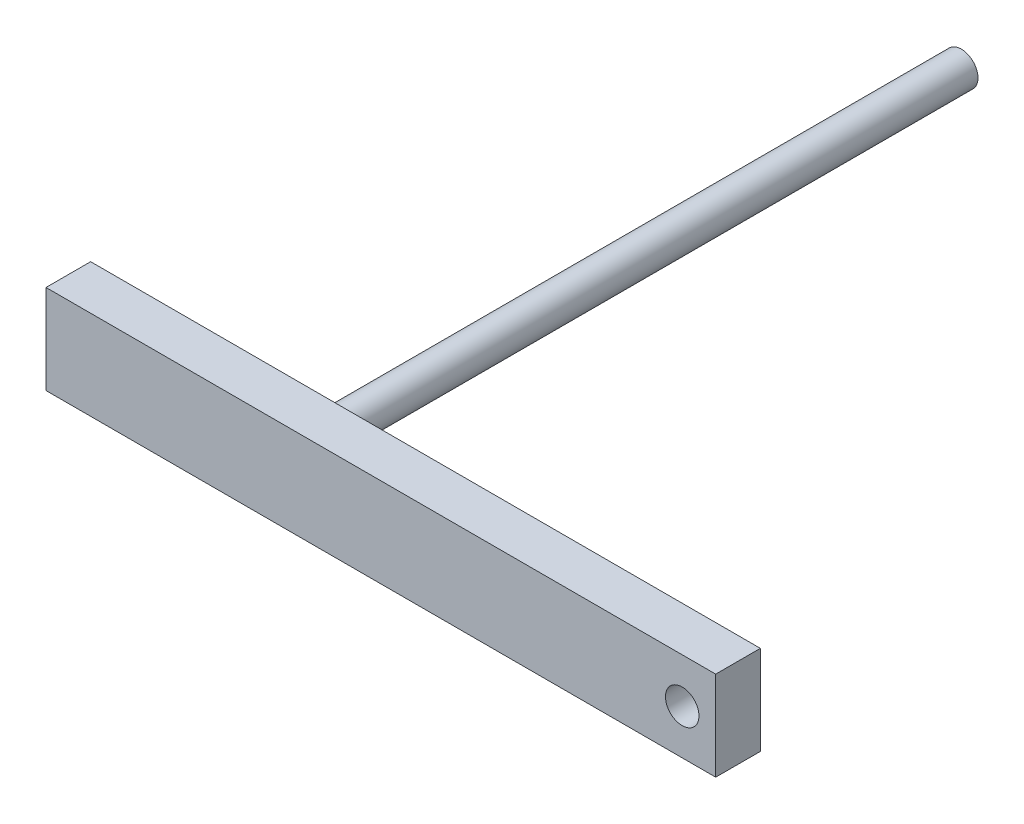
from build123d import *

# Parameters (mm, degrees)
ESQUISSE1_W             = 60
ESQUISSE1_H             = 8
BOSS_EXTRU_1_DEPTH      = 4
ESQUISSE2_R             = 1.5
BOSS_EXTRU_2_DEPTH      = 58
ESQUISSE3_R             = 1.5
ENL_V_MAT_EXTRU_1_DEPTH = 66.421708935


with BuildPart() as part:
    # Esquisse1 → Boss.-Extru.1 (new body)
    with BuildSketch(Plane.XY):
        Rectangle(ESQUISSE1_W, ESQUISSE1_H)
    extrude(amount=BOSS_EXTRU_1_DEPTH)

    # Esquisse2 → Boss.-Extru.2 (add)
    with BuildSketch(Plane(origin=(0, 0, 0), x_dir=(-1, 0, 0), z_dir=(0, 0, -1))):
        with Locations(Location((10, 0, 0), (0, 0, 180))):
            Circle(ESQUISSE2_R)
    extrude(amount=BOSS_EXTRU_2_DEPTH)

    # Esquisse3 → Enl_v. mat.-Extru.1 (cut, through all)
    with BuildSketch(Plane(origin=(0, 0, 0), x_dir=(-1, 0, 0), z_dir=(0, 0, -1))):
        with Locations((-27, 0)):
            Circle(ESQUISSE3_R)
    extrude(amount=-ENL_V_MAT_EXTRU_1_DEPTH, mode=Mode.SUBTRACT)


solid = part.part
